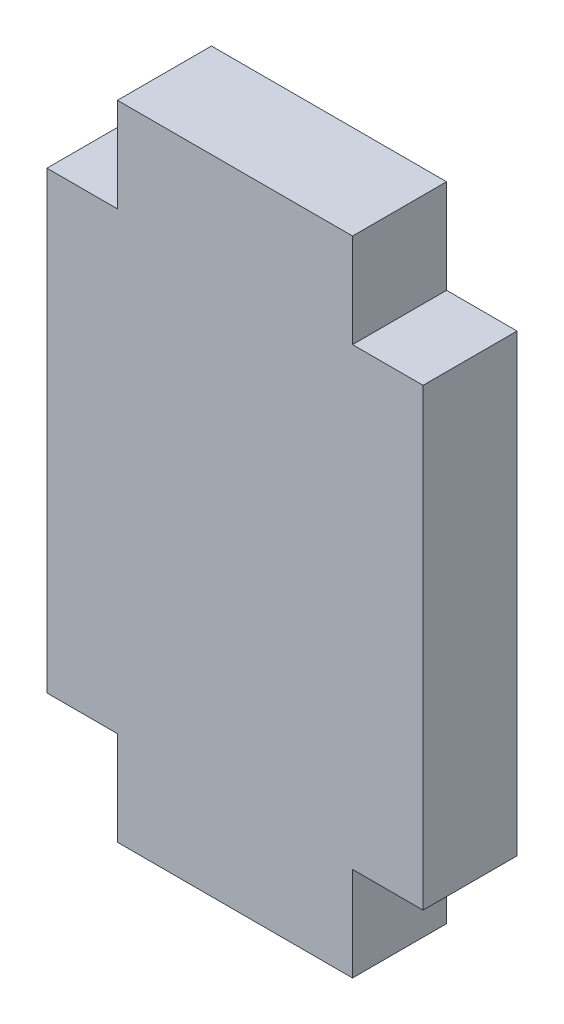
ISO-10303-21;
HEADER;
FILE_DESCRIPTION(('STEP AP214'),'2;1');
FILE_NAME('part.step','',(''),(''),'','','');
FILE_SCHEMA(('AUTOMOTIVE_DESIGN { 1 0 10303 214 1 1 1 1 }'));
ENDSEC;
DATA;
#1=APPLICATION_CONTEXT('core data for automotive mechanical design processes');
#2=APPLICATION_PROTOCOL_DEFINITION('international standard','automotive_design',2000,#1);
#3=PRODUCT_CONTEXT('',#1,'mechanical');
#4=PRODUCT('Part','Part','',(#3));
#5=PRODUCT_RELATED_PRODUCT_CATEGORY('part','',(#4));
#6=PRODUCT_DEFINITION_FORMATION('','',#4);
#7=PRODUCT_DEFINITION_CONTEXT('part definition',#1,'design');
#8=PRODUCT_DEFINITION('design','',#6,#7);
#9=PRODUCT_DEFINITION_SHAPE('','',#8);
#10=(LENGTH_UNIT() NAMED_UNIT(*) SI_UNIT(.MILLI.,.METRE.));
#11=(NAMED_UNIT(*) PLANE_ANGLE_UNIT() SI_UNIT($,.RADIAN.));
#12=(NAMED_UNIT(*) SI_UNIT($,.STERADIAN.) SOLID_ANGLE_UNIT());
#13=UNCERTAINTY_MEASURE_WITH_UNIT(LENGTH_MEASURE(1.E-05),#10,'distance_accuracy_value','');
#14=(GEOMETRIC_REPRESENTATION_CONTEXT(3) GLOBAL_UNCERTAINTY_ASSIGNED_CONTEXT((#13)) GLOBAL_UNIT_ASSIGNED_CONTEXT((#10,
#11,#12)) REPRESENTATION_CONTEXT('',''));
#15=CARTESIAN_POINT('',(0.,0.,0.));
#16=DIRECTION('',(0.,0.,1.));
#17=DIRECTION('',(1.,0.,0.));
#18=AXIS2_PLACEMENT_3D('',#15,#16,#17);
#19=CARTESIAN_POINT('',(0.,0.,0.));
#20=DIRECTION('',(0.,0.,-1.));
#21=DIRECTION('',(-1.,0.,0.));
#22=AXIS2_PLACEMENT_3D('',#19,#20,#21);
#23=PLANE('',#22);
#24=DIRECTION('',(-1.,0.,0.));
#25=VECTOR('',#24,1.);
#26=CARTESIAN_POINT('',(-17.4819559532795,17.5,0.));
#27=LINE('',#26,#25);
#28=CARTESIAN_POINT('',(-9.9819559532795,17.5,0.));
#29=VERTEX_POINT('',#28);
#30=CARTESIAN_POINT('',(-17.4819559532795,17.5,0.));
#31=VERTEX_POINT('',#30);
#32=EDGE_CURVE('E138',#29,#31,#27,.T.);
#33=ORIENTED_EDGE('',*,*,#32,.F.);
#34=DIRECTION('',(0.,1.,0.));
#35=VECTOR('',#34,1.);
#36=CARTESIAN_POINT('',(-9.9819559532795,17.5,0.));
#37=LINE('',#36,#35);
#38=CARTESIAN_POINT('',(-9.9819559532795,14.5,0.));
#39=VERTEX_POINT('',#38);
#40=EDGE_CURVE('E386',#39,#29,#37,.T.);
#41=ORIENTED_EDGE('',*,*,#40,.F.);
#42=DIRECTION('',(-1.,0.,0.));
#43=VECTOR('',#42,1.);
#44=CARTESIAN_POINT('',(-9.9819559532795,14.5,0.));
#45=LINE('',#44,#43);
#46=CARTESIAN_POINT('',(-7.7319559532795,14.5,0.));
#47=VERTEX_POINT('',#46);
#48=EDGE_CURVE('E388',#47,#39,#45,.T.);
#49=ORIENTED_EDGE('',*,*,#48,.F.);
#50=DIRECTION('',(0.,1.,0.));
#51=VECTOR('',#50,1.);
#52=CARTESIAN_POINT('',(-7.7319559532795,14.5,0.));
#53=LINE('',#52,#51);
#54=CARTESIAN_POINT('',(-7.73195595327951,0.,0.));
#55=VERTEX_POINT('',#54);
#56=EDGE_CURVE('E405',#55,#47,#53,.T.);
#57=ORIENTED_EDGE('',*,*,#56,.F.);
#58=DIRECTION('',(1.,0.,0.));
#59=VECTOR('',#58,1.);
#60=CARTESIAN_POINT('',(-7.73195595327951,0.,0.));
#61=LINE('',#60,#59);
#62=CARTESIAN_POINT('',(-9.98195595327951,0.,0.));
#63=VERTEX_POINT('',#62);
#64=EDGE_CURVE('E408',#63,#55,#61,.T.);
#65=ORIENTED_EDGE('',*,*,#64,.F.);
#66=DIRECTION('',(0.,1.,0.));
#67=VECTOR('',#66,1.);
#68=CARTESIAN_POINT('',(-9.98195595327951,0.,0.));
#69=LINE('',#68,#67);
#70=CARTESIAN_POINT('',(-9.9819559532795,-3.,0.));
#71=VERTEX_POINT('',#70);
#72=EDGE_CURVE('E425',#71,#63,#69,.T.);
#73=ORIENTED_EDGE('',*,*,#72,.F.);
#74=DIRECTION('',(1.,0.,0.));
#75=VECTOR('',#74,1.);
#76=CARTESIAN_POINT('',(-17.4819559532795,-3.,0.));
#77=LINE('',#76,#75);
#78=CARTESIAN_POINT('',(-17.4819559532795,-3.,0.));
#79=VERTEX_POINT('',#78);
#80=EDGE_CURVE('E428',#79,#71,#77,.T.);
#81=ORIENTED_EDGE('',*,*,#80,.F.);
#82=DIRECTION('',(0.,-1.,0.));
#83=VECTOR('',#82,1.);
#84=CARTESIAN_POINT('',(-17.4819559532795,0.,0.));
#85=LINE('',#84,#83);
#86=CARTESIAN_POINT('',(-17.4819559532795,0.,0.));
#87=VERTEX_POINT('',#86);
#88=EDGE_CURVE('E445',#87,#79,#85,.T.);
#89=ORIENTED_EDGE('',*,*,#88,.F.);
#90=DIRECTION('',(1.,0.,0.));
#91=VECTOR('',#90,1.);
#92=CARTESIAN_POINT('',(-19.7319559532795,0.,0.));
#93=LINE('',#92,#91);
#94=CARTESIAN_POINT('',(-19.7319559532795,0.,0.));
#95=VERTEX_POINT('',#94);
#96=EDGE_CURVE('E448',#95,#87,#93,.T.);
#97=ORIENTED_EDGE('',*,*,#96,.F.);
#98=DIRECTION('',(0.,-1.,0.));
#99=VECTOR('',#98,1.);
#100=CARTESIAN_POINT('',(-19.7319559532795,14.5,0.));
#101=LINE('',#100,#99);
#102=CARTESIAN_POINT('',(-19.7319559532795,14.5,0.));
#103=VERTEX_POINT('',#102);
#104=EDGE_CURVE('E462',#103,#95,#101,.T.);
#105=ORIENTED_EDGE('',*,*,#104,.F.);
#106=DIRECTION('',(-1.,0.,0.));
#107=VECTOR('',#106,1.);
#108=CARTESIAN_POINT('',(-17.4819559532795,14.5,0.));
#109=LINE('',#108,#107);
#110=CARTESIAN_POINT('',(-17.4819559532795,14.5,0.));
#111=VERTEX_POINT('',#110);
#112=EDGE_CURVE('E141',#111,#103,#109,.T.);
#113=ORIENTED_EDGE('',*,*,#112,.F.);
#114=DIRECTION('',(0.,-1.,0.));
#115=VECTOR('',#114,1.);
#116=CARTESIAN_POINT('',(-17.4819559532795,17.5,0.));
#117=LINE('',#116,#115);
#118=EDGE_CURVE('E130',#31,#111,#117,.T.);
#119=ORIENTED_EDGE('',*,*,#118,.F.);
#120=EDGE_LOOP('',(#33,#41,#49,#57,#65,#73,#81,#89,#97,#105,#113,#119));
#121=FACE_BOUND('',#120,.T.);
#122=ADVANCED_FACE('F37',(#121),#23,.T.);
#123=CARTESIAN_POINT('',(-9.9819559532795,17.5,26.7539470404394));
#124=DIRECTION('',(-1.,0.,0.));
#125=DIRECTION('',(0.,0.,1.));
#126=AXIS2_PLACEMENT_3D('',#123,#124,#125);
#127=PLANE('',#126);
#128=DIRECTION('',(0.,0.,-1.));
#129=VECTOR('',#128,1.);
#130=CARTESIAN_POINT('',(-9.9819559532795,17.5,26.7539470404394));
#131=LINE('',#130,#129);
#132=CARTESIAN_POINT('',(-9.9819559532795,17.5,2.99999999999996));
#133=VERTEX_POINT('',#132);
#134=EDGE_CURVE('E144',#133,#29,#131,.T.);
#135=ORIENTED_EDGE('',*,*,#134,.F.);
#136=DIRECTION('',(0.,-1.,0.));
#137=VECTOR('',#136,1.);
#138=CARTESIAN_POINT('',(-9.9819559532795,17.5,2.99999999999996));
#139=LINE('',#138,#137);
#140=CARTESIAN_POINT('',(-9.9819559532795,14.5,2.99999999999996));
#141=VERTEX_POINT('',#140);
#142=EDGE_CURVE('E41',#133,#141,#139,.T.);
#143=ORIENTED_EDGE('',*,*,#142,.T.);
#144=DIRECTION('',(0.,0.,-1.));
#145=VECTOR('',#144,1.);
#146=CARTESIAN_POINT('',(-9.9819559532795,14.5,26.7539470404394));
#147=LINE('',#146,#145);
#148=EDGE_CURVE('E368',#141,#39,#147,.T.);
#149=ORIENTED_EDGE('',*,*,#148,.T.);
#150=ORIENTED_EDGE('',*,*,#40,.T.);
#151=EDGE_LOOP('',(#135,#143,#149,#150));
#152=FACE_BOUND('',#151,.T.);
#153=ADVANCED_FACE('F540',(#152),#127,.F.);
#154=CARTESIAN_POINT('',(-9.9819559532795,14.5,26.7539470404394));
#155=DIRECTION('',(0.,-1.,0.));
#156=DIRECTION('',(0.,0.,-1.));
#157=AXIS2_PLACEMENT_3D('',#154,#155,#156);
#158=PLANE('',#157);
#159=ORIENTED_EDGE('',*,*,#148,.F.);
#160=DIRECTION('',(1.,0.,0.));
#161=VECTOR('',#160,1.);
#162=CARTESIAN_POINT('',(-9.9819559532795,14.5,2.99999999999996));
#163=LINE('',#162,#161);
#164=CARTESIAN_POINT('',(-7.7319559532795,14.5,2.99999999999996));
#165=VERTEX_POINT('',#164);
#166=EDGE_CURVE('E255',#141,#165,#163,.T.);
#167=ORIENTED_EDGE('',*,*,#166,.T.);
#168=DIRECTION('',(0.,0.,-1.));
#169=VECTOR('',#168,1.);
#170=CARTESIAN_POINT('',(-7.7319559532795,14.5,26.7539470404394));
#171=LINE('',#170,#169);
#172=EDGE_CURVE('E351',#165,#47,#171,.T.);
#173=ORIENTED_EDGE('',*,*,#172,.T.);
#174=ORIENTED_EDGE('',*,*,#48,.T.);
#175=EDGE_LOOP('',(#159,#167,#173,#174));
#176=FACE_BOUND('',#175,.T.);
#177=ADVANCED_FACE('F537',(#176),#158,.F.);
#178=CARTESIAN_POINT('',(-7.7319559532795,14.5,26.7539470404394));
#179=DIRECTION('',(-1.,0.,0.));
#180=DIRECTION('',(0.,-1.,0.));
#181=AXIS2_PLACEMENT_3D('',#178,#179,#180);
#182=PLANE('',#181);
#183=ORIENTED_EDGE('',*,*,#172,.F.);
#184=DIRECTION('',(0.,-1.,0.));
#185=VECTOR('',#184,1.);
#186=CARTESIAN_POINT('',(-7.7319559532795,14.5,2.99999999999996));
#187=LINE('',#186,#185);
#188=CARTESIAN_POINT('',(-7.73195595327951,0.,2.99999999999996));
#189=VERTEX_POINT('',#188);
#190=EDGE_CURVE('E252',#165,#189,#187,.T.);
#191=ORIENTED_EDGE('',*,*,#190,.T.);
#192=DIRECTION('',(0.,0.,-1.));
#193=VECTOR('',#192,1.);
#194=CARTESIAN_POINT('',(-7.73195595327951,0.,26.7539470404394));
#195=LINE('',#194,#193);
#196=EDGE_CURVE('E349',#189,#55,#195,.T.);
#197=ORIENTED_EDGE('',*,*,#196,.T.);
#198=ORIENTED_EDGE('',*,*,#56,.T.);
#199=EDGE_LOOP('',(#183,#191,#197,#198));
#200=FACE_BOUND('',#199,.T.);
#201=ADVANCED_FACE('F531',(#200),#182,.F.);
#202=CARTESIAN_POINT('',(-7.73195595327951,0.,26.7539470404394));
#203=DIRECTION('',(0.,1.,0.));
#204=DIRECTION('',(-1.,0.,0.));
#205=AXIS2_PLACEMENT_3D('',#202,#203,#204);
#206=PLANE('',#205);
#207=ORIENTED_EDGE('',*,*,#196,.F.);
#208=DIRECTION('',(-1.,0.,0.));
#209=VECTOR('',#208,1.);
#210=CARTESIAN_POINT('',(-7.7319559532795,0.,2.99999999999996));
#211=LINE('',#210,#209);
#212=CARTESIAN_POINT('',(-9.98195595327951,0.,2.99999999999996));
#213=VERTEX_POINT('',#212);
#214=EDGE_CURVE('E235',#189,#213,#211,.T.);
#215=ORIENTED_EDGE('',*,*,#214,.T.);
#216=DIRECTION('',(0.,0.,-1.));
#217=VECTOR('',#216,1.);
#218=CARTESIAN_POINT('',(-9.98195595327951,0.,26.7539470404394));
#219=LINE('',#218,#217);
#220=EDGE_CURVE('E332',#213,#63,#219,.T.);
#221=ORIENTED_EDGE('',*,*,#220,.T.);
#222=ORIENTED_EDGE('',*,*,#64,.T.);
#223=EDGE_LOOP('',(#207,#215,#221,#222));
#224=FACE_BOUND('',#223,.T.);
#225=ADVANCED_FACE('F527',(#224),#206,.F.);
#226=CARTESIAN_POINT('',(-9.98195595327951,0.,26.7539470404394));
#227=DIRECTION('',(-1.,0.,0.));
#228=DIRECTION('',(0.,-1.,0.));
#229=AXIS2_PLACEMENT_3D('',#226,#227,#228);
#230=PLANE('',#229);
#231=ORIENTED_EDGE('',*,*,#220,.F.);
#232=DIRECTION('',(0.,-1.,0.));
#233=VECTOR('',#232,1.);
#234=CARTESIAN_POINT('',(-9.98195595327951,0.,2.99999999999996));
#235=LINE('',#234,#233);
#236=CARTESIAN_POINT('',(-9.9819559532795,-3.,2.99999999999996));
#237=VERTEX_POINT('',#236);
#238=EDGE_CURVE('E232',#213,#237,#235,.T.);
#239=ORIENTED_EDGE('',*,*,#238,.T.);
#240=DIRECTION('',(0.,0.,-1.));
#241=VECTOR('',#240,1.);
#242=CARTESIAN_POINT('',(-9.9819559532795,-3.,26.7539470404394));
#243=LINE('',#242,#241);
#244=EDGE_CURVE('E330',#237,#71,#243,.T.);
#245=ORIENTED_EDGE('',*,*,#244,.T.);
#246=ORIENTED_EDGE('',*,*,#72,.T.);
#247=EDGE_LOOP('',(#231,#239,#245,#246));
#248=FACE_BOUND('',#247,.T.);
#249=ADVANCED_FACE('F522',(#248),#230,.F.);
#250=CARTESIAN_POINT('',(-17.4819559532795,-3.,26.7539470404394));
#251=DIRECTION('',(0.,1.,0.));
#252=DIRECTION('',(0.,0.,1.));
#253=AXIS2_PLACEMENT_3D('',#250,#251,#252);
#254=PLANE('',#253);
#255=ORIENTED_EDGE('',*,*,#244,.F.);
#256=DIRECTION('',(-1.,0.,0.));
#257=VECTOR('',#256,1.);
#258=CARTESIAN_POINT('',(-17.4819559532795,-3.,2.99999999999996));
#259=LINE('',#258,#257);
#260=CARTESIAN_POINT('',(-17.4819559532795,-3.,2.99999999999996));
#261=VERTEX_POINT('',#260);
#262=EDGE_CURVE('E215',#237,#261,#259,.T.);
#263=ORIENTED_EDGE('',*,*,#262,.T.);
#264=DIRECTION('',(0.,0.,-1.));
#265=VECTOR('',#264,1.);
#266=CARTESIAN_POINT('',(-17.4819559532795,-3.,26.7539470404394));
#267=LINE('',#266,#265);
#268=EDGE_CURVE('E313',#261,#79,#267,.T.);
#269=ORIENTED_EDGE('',*,*,#268,.T.);
#270=ORIENTED_EDGE('',*,*,#80,.T.);
#271=EDGE_LOOP('',(#255,#263,#269,#270));
#272=FACE_BOUND('',#271,.T.);
#273=ADVANCED_FACE('F517',(#272),#254,.F.);
#274=CARTESIAN_POINT('',(-17.4819559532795,0.,26.7539470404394));
#275=DIRECTION('',(1.,0.,0.));
#276=DIRECTION('',(0.,1.,0.));
#277=AXIS2_PLACEMENT_3D('',#274,#275,#276);
#278=PLANE('',#277);
#279=ORIENTED_EDGE('',*,*,#268,.F.);
#280=DIRECTION('',(0.,1.,0.));
#281=VECTOR('',#280,1.);
#282=CARTESIAN_POINT('',(-17.4819559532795,0.,2.99999999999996));
#283=LINE('',#282,#281);
#284=CARTESIAN_POINT('',(-17.4819559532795,0.,2.99999999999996));
#285=VERTEX_POINT('',#284);
#286=EDGE_CURVE('E212',#261,#285,#283,.T.);
#287=ORIENTED_EDGE('',*,*,#286,.T.);
#288=DIRECTION('',(0.,0.,-1.));
#289=VECTOR('',#288,1.);
#290=CARTESIAN_POINT('',(-17.4819559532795,0.,26.7539470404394));
#291=LINE('',#290,#289);
#292=EDGE_CURVE('E311',#285,#87,#291,.T.);
#293=ORIENTED_EDGE('',*,*,#292,.T.);
#294=ORIENTED_EDGE('',*,*,#88,.T.);
#295=EDGE_LOOP('',(#279,#287,#293,#294));
#296=FACE_BOUND('',#295,.T.);
#297=ADVANCED_FACE('F511',(#296),#278,.F.);
#298=CARTESIAN_POINT('',(-19.7319559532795,0.,26.7539470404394));
#299=DIRECTION('',(0.,1.,0.));
#300=DIRECTION('',(-1.,0.,0.));
#301=AXIS2_PLACEMENT_3D('',#298,#299,#300);
#302=PLANE('',#301);
#303=ORIENTED_EDGE('',*,*,#292,.F.);
#304=DIRECTION('',(-1.,0.,0.));
#305=VECTOR('',#304,1.);
#306=CARTESIAN_POINT('',(-19.7319559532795,0.,2.99999999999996));
#307=LINE('',#306,#305);
#308=CARTESIAN_POINT('',(-19.7319559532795,0.,2.99999999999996));
#309=VERTEX_POINT('',#308);
#310=EDGE_CURVE('E195',#285,#309,#307,.T.);
#311=ORIENTED_EDGE('',*,*,#310,.T.);
#312=DIRECTION('',(0.,0.,-1.));
#313=VECTOR('',#312,1.);
#314=CARTESIAN_POINT('',(-19.7319559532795,0.,26.7539470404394));
#315=LINE('',#314,#313);
#316=EDGE_CURVE('E294',#309,#95,#315,.T.);
#317=ORIENTED_EDGE('',*,*,#316,.T.);
#318=ORIENTED_EDGE('',*,*,#96,.T.);
#319=EDGE_LOOP('',(#303,#311,#317,#318));
#320=FACE_BOUND('',#319,.T.);
#321=ADVANCED_FACE('F509',(#320),#302,.F.);
#322=CARTESIAN_POINT('',(-19.7319559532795,14.5,26.7539470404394));
#323=DIRECTION('',(1.,0.,0.));
#324=DIRECTION('',(0.,1.,0.));
#325=AXIS2_PLACEMENT_3D('',#322,#323,#324);
#326=PLANE('',#325);
#327=ORIENTED_EDGE('',*,*,#316,.F.);
#328=DIRECTION('',(0.,1.,0.));
#329=VECTOR('',#328,1.);
#330=CARTESIAN_POINT('',(-19.7319559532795,14.5,2.99999999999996));
#331=LINE('',#330,#329);
#332=CARTESIAN_POINT('',(-19.7319559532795,14.5,2.99999999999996));
#333=VERTEX_POINT('',#332);
#334=EDGE_CURVE('E192',#309,#333,#331,.T.);
#335=ORIENTED_EDGE('',*,*,#334,.T.);
#336=DIRECTION('',(0.,0.,-1.));
#337=VECTOR('',#336,1.);
#338=CARTESIAN_POINT('',(-19.7319559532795,14.5,26.7539470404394));
#339=LINE('',#338,#337);
#340=EDGE_CURVE('E292',#333,#103,#339,.T.);
#341=ORIENTED_EDGE('',*,*,#340,.T.);
#342=ORIENTED_EDGE('',*,*,#104,.T.);
#343=EDGE_LOOP('',(#327,#335,#341,#342));
#344=FACE_BOUND('',#343,.T.);
#345=ADVANCED_FACE('F503',(#344),#326,.F.);
#346=CARTESIAN_POINT('',(-17.4819559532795,14.5,26.7539470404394));
#347=DIRECTION('',(0.,-1.,0.));
#348=DIRECTION('',(0.,0.,-1.));
#349=AXIS2_PLACEMENT_3D('',#346,#347,#348);
#350=PLANE('',#349);
#351=ORIENTED_EDGE('',*,*,#340,.F.);
#352=DIRECTION('',(1.,0.,0.));
#353=VECTOR('',#352,1.);
#354=CARTESIAN_POINT('',(-17.4819559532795,14.5,2.99999999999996));
#355=LINE('',#354,#353);
#356=CARTESIAN_POINT('',(-17.4819559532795,14.5,2.99999999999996));
#357=VERTEX_POINT('',#356);
#358=EDGE_CURVE('E59',#333,#357,#355,.T.);
#359=ORIENTED_EDGE('',*,*,#358,.T.);
#360=DIRECTION('',(0.,0.,-1.));
#361=VECTOR('',#360,1.);
#362=CARTESIAN_POINT('',(-17.4819559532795,14.5,26.7539470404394));
#363=LINE('',#362,#361);
#364=EDGE_CURVE('E134',#357,#111,#363,.T.);
#365=ORIENTED_EDGE('',*,*,#364,.T.);
#366=ORIENTED_EDGE('',*,*,#112,.T.);
#367=EDGE_LOOP('',(#351,#359,#365,#366));
#368=FACE_BOUND('',#367,.T.);
#369=ADVANCED_FACE('F497',(#368),#350,.F.);
#370=CARTESIAN_POINT('',(-17.4819559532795,17.5,26.7539470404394));
#371=DIRECTION('',(1.,0.,0.));
#372=DIRECTION('',(0.,0.,-1.));
#373=AXIS2_PLACEMENT_3D('',#370,#371,#372);
#374=PLANE('',#373);
#375=ORIENTED_EDGE('',*,*,#364,.F.);
#376=DIRECTION('',(0.,1.,0.));
#377=VECTOR('',#376,1.);
#378=CARTESIAN_POINT('',(-17.4819559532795,17.5,2.99999999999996));
#379=LINE('',#378,#377);
#380=CARTESIAN_POINT('',(-17.4819559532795,17.5,2.99999999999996));
#381=VERTEX_POINT('',#380);
#382=EDGE_CURVE('E47',#357,#381,#379,.T.);
#383=ORIENTED_EDGE('',*,*,#382,.T.);
#384=DIRECTION('',(0.,0.,-1.));
#385=VECTOR('',#384,1.);
#386=CARTESIAN_POINT('',(-17.4819559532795,17.5,26.7539470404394));
#387=LINE('',#386,#385);
#388=EDGE_CURVE('E127',#381,#31,#387,.T.);
#389=ORIENTED_EDGE('',*,*,#388,.T.);
#390=ORIENTED_EDGE('',*,*,#118,.T.);
#391=EDGE_LOOP('',(#375,#383,#389,#390));
#392=FACE_BOUND('',#391,.T.);
#393=ADVANCED_FACE('F129',(#392),#374,.F.);
#394=CARTESIAN_POINT('',(-17.4819559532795,17.5,26.7539470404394));
#395=DIRECTION('',(0.,-1.,0.));
#396=DIRECTION('',(0.,0.,-1.));
#397=AXIS2_PLACEMENT_3D('',#394,#395,#396);
#398=PLANE('',#397);
#399=ORIENTED_EDGE('',*,*,#388,.F.);
#400=DIRECTION('',(1.,0.,0.));
#401=VECTOR('',#400,1.);
#402=CARTESIAN_POINT('',(-17.4819559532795,17.5,2.99999999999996));
#403=LINE('',#402,#401);
#404=EDGE_CURVE('E12',#381,#133,#403,.T.);
#405=ORIENTED_EDGE('',*,*,#404,.T.);
#406=ORIENTED_EDGE('',*,*,#134,.T.);
#407=ORIENTED_EDGE('',*,*,#32,.T.);
#408=EDGE_LOOP('',(#399,#405,#406,#407));
#409=FACE_BOUND('',#408,.T.);
#410=ADVANCED_FACE('F39',(#409),#398,.F.);
#411=CARTESIAN_POINT('',(-8.,14.5,2.99999999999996));
#412=DIRECTION('',(0.,0.,-1.));
#413=DIRECTION('',(0.,-1.,0.));
#414=AXIS2_PLACEMENT_3D('',#411,#412,#413);
#415=PLANE('',#414);
#416=ORIENTED_EDGE('',*,*,#382,.F.);
#417=ORIENTED_EDGE('',*,*,#358,.F.);
#418=ORIENTED_EDGE('',*,*,#334,.F.);
#419=ORIENTED_EDGE('',*,*,#310,.F.);
#420=ORIENTED_EDGE('',*,*,#286,.F.);
#421=ORIENTED_EDGE('',*,*,#262,.F.);
#422=ORIENTED_EDGE('',*,*,#238,.F.);
#423=ORIENTED_EDGE('',*,*,#214,.F.);
#424=ORIENTED_EDGE('',*,*,#190,.F.);
#425=ORIENTED_EDGE('',*,*,#166,.F.);
#426=ORIENTED_EDGE('',*,*,#142,.F.);
#427=ORIENTED_EDGE('',*,*,#404,.F.);
#428=EDGE_LOOP('',(#416,#417,#418,#419,#420,#421,#422,#423,#424,#425,#426,#427));
#429=FACE_BOUND('',#428,.T.);
#430=ADVANCED_FACE('F505',(#429),#415,.F.);
#431=CLOSED_SHELL('',(#122,#153,#177,#201,#225,#249,#273,#297,#321,#345,#369,#393,#410,#430));
#432=MANIFOLD_SOLID_BREP('B2',#431);
#433=ADVANCED_BREP_SHAPE_REPRESENTATION('',(#18,#432),#14);
#434=SHAPE_DEFINITION_REPRESENTATION(#9,#433);
ENDSEC;
END-ISO-10303-21;
